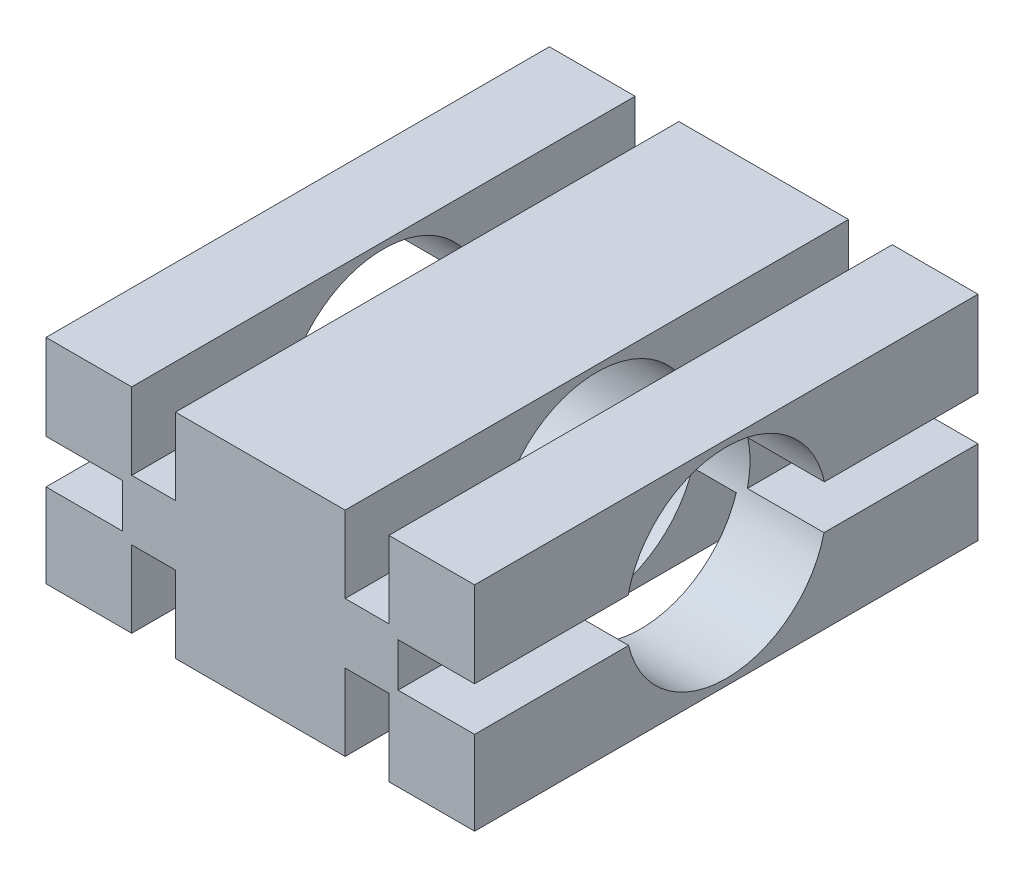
from build123d import *

# Parameters (mm, degrees)
BOSS_EXTRUDE1_DEPTH = 70.104
SKETCH2_R           = 13.97
CUT_EXTRUDE1_DEPTH  = 97.750330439


with BuildPart() as part:
    # Sketch1 → Boss-Extrude1 (new body)
    with BuildSketch(Plane.XY):
        Polygon((0, 0), (11.938, 0), (11.938, 10.668), (18.034, 10.668), (18.034, 0), (41.656, 0), (41.656, 10.668), (47.752, 10.668), (47.752, 0), (59.69, 0), (59.69, 11.684), (49.022, 11.684), (49.022, 17.78), (59.69, 17.78), (59.69, 29.718), (47.752, 29.718), (47.752, 19.05), (41.656, 19.05), (41.656, 29.718), (18.034, 29.718), (18.034, 19.05), (11.938, 19.05), (11.938, 29.718), (0, 29.718), (0, 17.78), (10.668, 17.78), (10.668, 11.684), (0, 11.684), align=None)
    extrude(amount=BOSS_EXTRUDE1_DEPTH)

    # Sketch2 → Cut-Extrude1 (cut, through all)
    with BuildSketch(Plane.ZY):
        with Locations(Location((35.052, 14.859, 0), (0, 0, 346.863441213))):
            Circle(SKETCH2_R)
    extrude(amount=-CUT_EXTRUDE1_DEPTH, mode=Mode.SUBTRACT)


solid = part.part
